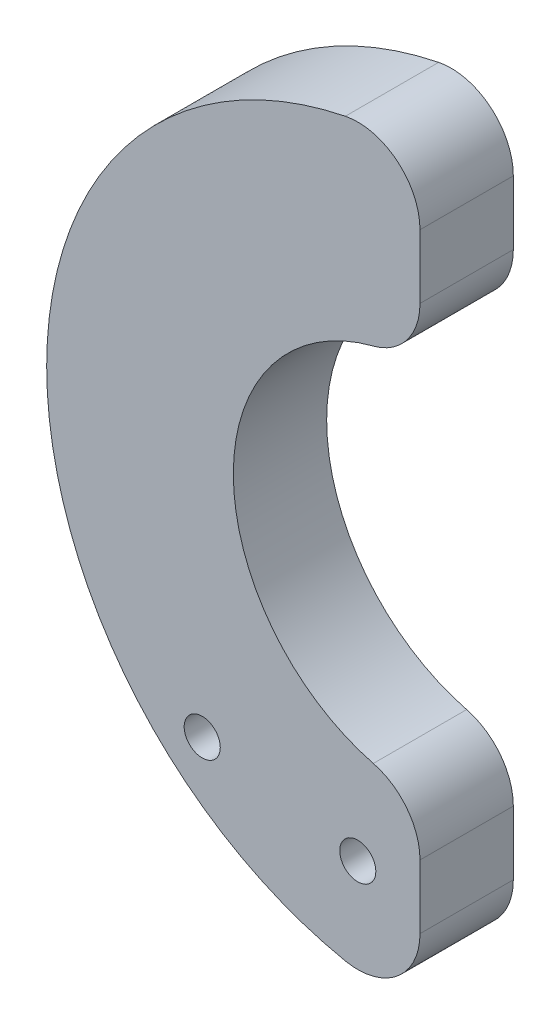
ISO-10303-21;
HEADER;
FILE_DESCRIPTION(('STEP AP214'),'2;1');
FILE_NAME('part.step','',(''),(''),'','','');
FILE_SCHEMA(('AUTOMOTIVE_DESIGN { 1 0 10303 214 1 1 1 1 }'));
ENDSEC;
DATA;
#1=APPLICATION_CONTEXT('core data for automotive mechanical design processes');
#2=APPLICATION_PROTOCOL_DEFINITION('international standard','automotive_design',2000,#1);
#3=PRODUCT_CONTEXT('',#1,'mechanical');
#4=PRODUCT('Part','Part','',(#3));
#5=PRODUCT_RELATED_PRODUCT_CATEGORY('part','',(#4));
#6=PRODUCT_DEFINITION_FORMATION('','',#4);
#7=PRODUCT_DEFINITION_CONTEXT('part definition',#1,'design');
#8=PRODUCT_DEFINITION('design','',#6,#7);
#9=PRODUCT_DEFINITION_SHAPE('','',#8);
#10=(LENGTH_UNIT() NAMED_UNIT(*) SI_UNIT(.MILLI.,.METRE.));
#11=(NAMED_UNIT(*) PLANE_ANGLE_UNIT() SI_UNIT($,.RADIAN.));
#12=(NAMED_UNIT(*) SI_UNIT($,.STERADIAN.) SOLID_ANGLE_UNIT());
#13=UNCERTAINTY_MEASURE_WITH_UNIT(LENGTH_MEASURE(1.E-05),#10,'distance_accuracy_value','');
#14=(GEOMETRIC_REPRESENTATION_CONTEXT(3) GLOBAL_UNCERTAINTY_ASSIGNED_CONTEXT((#13)) GLOBAL_UNIT_ASSIGNED_CONTEXT((#10,
#11,#12)) REPRESENTATION_CONTEXT('',''));
#15=CARTESIAN_POINT('',(0.,0.,0.));
#16=DIRECTION('',(0.,0.,1.));
#17=DIRECTION('',(1.,0.,0.));
#18=AXIS2_PLACEMENT_3D('',#15,#16,#17);
#19=CARTESIAN_POINT('',(-3.175,12.2967221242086,4.7625));
#20=DIRECTION('',(0.,0.,-1.));
#21=DIRECTION('',(-1.,0.,0.));
#22=AXIS2_PLACEMENT_3D('',#19,#20,#21);
#23=CYLINDRICAL_SURFACE('',#22,3.175);
#24=CARTESIAN_POINT('',(-3.175,12.2967221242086,0.));
#25=DIRECTION('',(0.,0.,-1.));
#26=DIRECTION('',(-1.,0.,0.));
#27=AXIS2_PLACEMENT_3D('',#24,#25,#26);
#28=CIRCLE('',#27,3.175);
#29=CARTESIAN_POINT('',(0.,12.2967221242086,0.));
#30=VERTEX_POINT('',#29);
#31=CARTESIAN_POINT('',(-2.38125,9.22254159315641,0.));
#32=VERTEX_POINT('',#31);
#33=EDGE_CURVE('E141',#30,#32,#28,.T.);
#34=ORIENTED_EDGE('',*,*,#33,.F.);
#35=DIRECTION('',(0.,0.,-1.));
#36=VECTOR('',#35,1.);
#37=CARTESIAN_POINT('',(0.,12.2967221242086,4.7625));
#38=LINE('',#37,#36);
#39=CARTESIAN_POINT('',(0.,12.2967221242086,4.7625));
#40=VERTEX_POINT('',#39);
#41=EDGE_CURVE('E13',#40,#30,#38,.T.);
#42=ORIENTED_EDGE('',*,*,#41,.F.);
#43=CARTESIAN_POINT('',(-3.175,12.2967221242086,4.7625));
#44=DIRECTION('',(0.,0.,-1.));
#45=DIRECTION('',(-1.,0.,0.));
#46=AXIS2_PLACEMENT_3D('',#43,#44,#45);
#47=CIRCLE('',#46,3.175);
#48=CARTESIAN_POINT('',(-2.38125,9.22254159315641,4.7625));
#49=VERTEX_POINT('',#48);
#50=EDGE_CURVE('E162',#40,#49,#47,.T.);
#51=ORIENTED_EDGE('',*,*,#50,.T.);
#52=DIRECTION('',(0.,0.,-1.));
#53=VECTOR('',#52,1.);
#54=CARTESIAN_POINT('',(-2.38125,9.22254159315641,4.7625));
#55=LINE('',#54,#53);
#56=EDGE_CURVE('E47',#49,#32,#55,.T.);
#57=ORIENTED_EDGE('',*,*,#56,.T.);
#58=EDGE_LOOP('',(#34,#42,#51,#57));
#59=FACE_BOUND('',#58,.T.);
#60=ADVANCED_FACE('F44',(#59),#23,.T.);
#61=CARTESIAN_POINT('',(0.,15.5542598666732,4.7625));
#62=DIRECTION('',(1.,0.,0.));
#63=DIRECTION('',(0.,1.,0.));
#64=AXIS2_PLACEMENT_3D('',#61,#62,#63);
#65=PLANE('',#64);
#66=DIRECTION('',(0.,-1.,0.));
#67=VECTOR('',#66,1.);
#68=CARTESIAN_POINT('',(0.,15.5542598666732,0.));
#69=LINE('',#68,#67);
#70=CARTESIAN_POINT('',(0.,15.5542598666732,0.));
#71=VERTEX_POINT('',#70);
#72=EDGE_CURVE('E160',#71,#30,#69,.T.);
#73=ORIENTED_EDGE('',*,*,#72,.F.);
#74=DIRECTION('',(0.,0.,-1.));
#75=VECTOR('',#74,1.);
#76=CARTESIAN_POINT('',(0.,15.5542598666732,4.7625));
#77=LINE('',#76,#75);
#78=CARTESIAN_POINT('',(0.,15.5542598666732,4.7625));
#79=VERTEX_POINT('',#78);
#80=EDGE_CURVE('E53',#79,#71,#77,.T.);
#81=ORIENTED_EDGE('',*,*,#80,.F.);
#82=DIRECTION('',(0.,-1.,0.));
#83=VECTOR('',#82,1.);
#84=CARTESIAN_POINT('',(0.,15.5542598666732,4.7625));
#85=LINE('',#84,#83);
#86=EDGE_CURVE('E123',#79,#40,#85,.T.);
#87=ORIENTED_EDGE('',*,*,#86,.T.);
#88=ORIENTED_EDGE('',*,*,#41,.T.);
#89=EDGE_LOOP('',(#73,#81,#87,#88));
#90=FACE_BOUND('',#89,.T.);
#91=ADVANCED_FACE('F175',(#90),#65,.T.);
#92=CARTESIAN_POINT('',(-3.175,15.5542598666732,4.7625));
#93=DIRECTION('',(0.,0.,-1.));
#94=DIRECTION('',(-1.,0.,0.));
#95=AXIS2_PLACEMENT_3D('',#92,#93,#94);
#96=CYLINDRICAL_SURFACE('',#95,3.175);
#97=CARTESIAN_POINT('',(-3.175,15.5542598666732,0.));
#98=DIRECTION('',(0.,0.,1.));
#99=DIRECTION('',(1.,0.,0.));
#100=AXIS2_PLACEMENT_3D('',#97,#98,#99);
#101=CIRCLE('',#100,3.175);
#102=CARTESIAN_POINT('',(-3.81,18.6651118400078,0.));
#103=VERTEX_POINT('',#102);
#104=EDGE_CURVE('E127',#71,#103,#101,.T.);
#105=ORIENTED_EDGE('',*,*,#104,.T.);
#106=DIRECTION('',(0.,0.,-1.));
#107=VECTOR('',#106,1.);
#108=CARTESIAN_POINT('',(-3.81,18.6651118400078,4.7625));
#109=LINE('',#108,#107);
#110=CARTESIAN_POINT('',(-3.81,18.6651118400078,4.7625));
#111=VERTEX_POINT('',#110);
#112=EDGE_CURVE('E125',#111,#103,#109,.T.);
#113=ORIENTED_EDGE('',*,*,#112,.F.);
#114=CARTESIAN_POINT('',(-3.175,15.5542598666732,4.7625));
#115=DIRECTION('',(0.,0.,1.));
#116=DIRECTION('',(1.,0.,0.));
#117=AXIS2_PLACEMENT_3D('',#114,#115,#116);
#118=CIRCLE('',#117,3.175);
#119=EDGE_CURVE('E116',#79,#111,#118,.T.);
#120=ORIENTED_EDGE('',*,*,#119,.F.);
#121=ORIENTED_EDGE('',*,*,#80,.T.);
#122=EDGE_LOOP('',(#105,#113,#120,#121));
#123=FACE_BOUND('',#122,.T.);
#124=ADVANCED_FACE('F126',(#123),#96,.T.);
#125=CARTESIAN_POINT('',(0.,0.,4.7625));
#126=DIRECTION('',(0.,0.,-1.));
#127=DIRECTION('',(-1.,0.,0.));
#128=AXIS2_PLACEMENT_3D('',#125,#126,#127);
#129=CYLINDRICAL_SURFACE('',#128,19.05);
#130=CARTESIAN_POINT('',(0.,0.,0.));
#131=DIRECTION('',(0.,0.,-1.));
#132=DIRECTION('',(-1.,0.,0.));
#133=AXIS2_PLACEMENT_3D('',#130,#131,#132);
#134=CIRCLE('',#133,19.05);
#135=CARTESIAN_POINT('',(-3.81,-18.6651118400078,0.));
#136=VERTEX_POINT('',#135);
#137=EDGE_CURVE('E157',#136,#103,#134,.T.);
#138=ORIENTED_EDGE('',*,*,#137,.F.);
#139=DIRECTION('',(0.,0.,-1.));
#140=VECTOR('',#139,1.);
#141=CARTESIAN_POINT('',(-3.81,-18.6651118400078,4.7625));
#142=LINE('',#141,#140);
#143=CARTESIAN_POINT('',(-3.81,-18.6651118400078,4.7625));
#144=VERTEX_POINT('',#143);
#145=EDGE_CURVE('E131',#144,#136,#142,.T.);
#146=ORIENTED_EDGE('',*,*,#145,.F.);
#147=CARTESIAN_POINT('',(0.,0.,4.7625));
#148=DIRECTION('',(0.,0.,-1.));
#149=DIRECTION('',(-1.,0.,0.));
#150=AXIS2_PLACEMENT_3D('',#147,#148,#149);
#151=CIRCLE('',#150,19.05);
#152=EDGE_CURVE('E121',#144,#111,#151,.T.);
#153=ORIENTED_EDGE('',*,*,#152,.T.);
#154=ORIENTED_EDGE('',*,*,#112,.T.);
#155=EDGE_LOOP('',(#138,#146,#153,#154));
#156=FACE_BOUND('',#155,.T.);
#157=ADVANCED_FACE('F133',(#156),#129,.T.);
#158=CARTESIAN_POINT('',(-3.175,-15.5542598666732,4.7625));
#159=DIRECTION('',(0.,0.,-1.));
#160=DIRECTION('',(-1.,0.,0.));
#161=AXIS2_PLACEMENT_3D('',#158,#159,#160);
#162=CYLINDRICAL_SURFACE('',#161,3.175);
#163=CARTESIAN_POINT('',(-3.175,-15.5542598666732,0.));
#164=DIRECTION('',(0.,0.,-1.));
#165=DIRECTION('',(-1.,0.,0.));
#166=AXIS2_PLACEMENT_3D('',#163,#164,#165);
#167=CIRCLE('',#166,3.175);
#168=CARTESIAN_POINT('',(0.,-15.5542598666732,0.));
#169=VERTEX_POINT('',#168);
#170=EDGE_CURVE('E154',#169,#136,#167,.T.);
#171=ORIENTED_EDGE('',*,*,#170,.F.);
#172=DIRECTION('',(0.,0.,-1.));
#173=VECTOR('',#172,1.);
#174=CARTESIAN_POINT('',(0.,-15.5542598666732,4.7625));
#175=LINE('',#174,#173);
#176=CARTESIAN_POINT('',(0.,-15.5542598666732,4.7625));
#177=VERTEX_POINT('',#176);
#178=EDGE_CURVE('E166',#177,#169,#175,.T.);
#179=ORIENTED_EDGE('',*,*,#178,.F.);
#180=CARTESIAN_POINT('',(-3.175,-15.5542598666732,4.7625));
#181=DIRECTION('',(0.,0.,-1.));
#182=DIRECTION('',(-1.,0.,0.));
#183=AXIS2_PLACEMENT_3D('',#180,#181,#182);
#184=CIRCLE('',#183,3.175);
#185=EDGE_CURVE('E134',#177,#144,#184,.T.);
#186=ORIENTED_EDGE('',*,*,#185,.T.);
#187=ORIENTED_EDGE('',*,*,#145,.T.);
#188=EDGE_LOOP('',(#171,#179,#186,#187));
#189=FACE_BOUND('',#188,.T.);
#190=ADVANCED_FACE('F188',(#189),#162,.T.);
#191=CARTESIAN_POINT('',(0.,-12.2967221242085,4.7625));
#192=DIRECTION('',(1.,0.,0.));
#193=DIRECTION('',(0.,1.,0.));
#194=AXIS2_PLACEMENT_3D('',#191,#192,#193);
#195=PLANE('',#194);
#196=DIRECTION('',(0.,-1.,0.));
#197=VECTOR('',#196,1.);
#198=CARTESIAN_POINT('',(0.,-12.2967221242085,0.));
#199=LINE('',#198,#197);
#200=CARTESIAN_POINT('',(0.,-12.2967221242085,0.));
#201=VERTEX_POINT('',#200);
#202=EDGE_CURVE('E151',#201,#169,#199,.T.);
#203=ORIENTED_EDGE('',*,*,#202,.F.);
#204=DIRECTION('',(0.,0.,-1.));
#205=VECTOR('',#204,1.);
#206=CARTESIAN_POINT('',(0.,-12.2967221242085,4.7625));
#207=LINE('',#206,#205);
#208=CARTESIAN_POINT('',(0.,-12.2967221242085,4.7625));
#209=VERTEX_POINT('',#208);
#210=EDGE_CURVE('E168',#209,#201,#207,.T.);
#211=ORIENTED_EDGE('',*,*,#210,.F.);
#212=DIRECTION('',(0.,-1.,0.));
#213=VECTOR('',#212,1.);
#214=CARTESIAN_POINT('',(0.,-12.2967221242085,4.7625));
#215=LINE('',#214,#213);
#216=EDGE_CURVE('E136',#209,#177,#215,.T.);
#217=ORIENTED_EDGE('',*,*,#216,.T.);
#218=ORIENTED_EDGE('',*,*,#178,.T.);
#219=EDGE_LOOP('',(#203,#211,#217,#218));
#220=FACE_BOUND('',#219,.T.);
#221=ADVANCED_FACE('F191',(#220),#195,.T.);
#222=CARTESIAN_POINT('',(-3.175,-12.2967221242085,4.7625));
#223=DIRECTION('',(0.,0.,-1.));
#224=DIRECTION('',(-1.,0.,0.));
#225=AXIS2_PLACEMENT_3D('',#222,#223,#224);
#226=CYLINDRICAL_SURFACE('',#225,3.175);
#227=CARTESIAN_POINT('',(-3.175,-12.2967221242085,0.));
#228=DIRECTION('',(0.,0.,1.));
#229=DIRECTION('',(1.,0.,0.));
#230=AXIS2_PLACEMENT_3D('',#227,#228,#229);
#231=CIRCLE('',#230,3.175);
#232=CARTESIAN_POINT('',(-2.38125,-9.22254159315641,0.));
#233=VERTEX_POINT('',#232);
#234=EDGE_CURVE('E148',#201,#233,#231,.T.);
#235=ORIENTED_EDGE('',*,*,#234,.T.);
#236=DIRECTION('',(0.,0.,-1.));
#237=VECTOR('',#236,1.);
#238=CARTESIAN_POINT('',(-2.38125,-9.22254159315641,4.7625));
#239=LINE('',#238,#237);
#240=CARTESIAN_POINT('',(-2.38125,-9.22254159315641,4.7625));
#241=VERTEX_POINT('',#240);
#242=EDGE_CURVE('E169',#241,#233,#239,.T.);
#243=ORIENTED_EDGE('',*,*,#242,.F.);
#244=CARTESIAN_POINT('',(-3.175,-12.2967221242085,4.7625));
#245=DIRECTION('',(0.,0.,1.));
#246=DIRECTION('',(1.,0.,0.));
#247=AXIS2_PLACEMENT_3D('',#244,#245,#246);
#248=CIRCLE('',#247,3.175);
#249=EDGE_CURVE('E237',#209,#241,#248,.T.);
#250=ORIENTED_EDGE('',*,*,#249,.F.);
#251=ORIENTED_EDGE('',*,*,#210,.T.);
#252=EDGE_LOOP('',(#235,#243,#250,#251));
#253=FACE_BOUND('',#252,.T.);
#254=ADVANCED_FACE('F195',(#253),#226,.T.);
#255=CARTESIAN_POINT('',(0.,0.,4.7625));
#256=DIRECTION('',(0.,0.,-1.));
#257=DIRECTION('',(-1.,0.,0.));
#258=AXIS2_PLACEMENT_3D('',#255,#256,#257);
#259=CYLINDRICAL_SURFACE('',#258,9.525);
#260=CARTESIAN_POINT('',(0.,0.,0.));
#261=DIRECTION('',(0.,0.,1.));
#262=DIRECTION('',(1.,0.,0.));
#263=AXIS2_PLACEMENT_3D('',#260,#261,#262);
#264=CIRCLE('',#263,9.525);
#265=EDGE_CURVE('E144',#32,#233,#264,.T.);
#266=ORIENTED_EDGE('',*,*,#265,.F.);
#267=ORIENTED_EDGE('',*,*,#56,.F.);
#268=CARTESIAN_POINT('',(0.,0.,4.7625));
#269=DIRECTION('',(0.,0.,1.));
#270=DIRECTION('',(1.,0.,0.));
#271=AXIS2_PLACEMENT_3D('',#268,#269,#270);
#272=CIRCLE('',#271,9.525);
#273=EDGE_CURVE('E235',#49,#241,#272,.T.);
#274=ORIENTED_EDGE('',*,*,#273,.T.);
#275=ORIENTED_EDGE('',*,*,#242,.T.);
#276=EDGE_LOOP('',(#266,#267,#274,#275));
#277=FACE_BOUND('',#276,.T.);
#278=ADVANCED_FACE('F171',(#277),#259,.F.);
#279=CARTESIAN_POINT('',(-3.175,12.2967221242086,4.7625));
#280=DIRECTION('',(0.,0.,-1.));
#281=DIRECTION('',(-1.,0.,0.));
#282=AXIS2_PLACEMENT_3D('',#279,#280,#281);
#283=PLANE('',#282);
#284=CARTESIAN_POINT('',(-3.175,-13.930255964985,4.7625));
#285=DIRECTION('',(0.,0.,1.));
#286=DIRECTION('',(1.,0.,0.));
#287=AXIS2_PLACEMENT_3D('',#284,#285,#286);
#288=CIRCLE('',#287,0.92075);
#289=CARTESIAN_POINT('',(-2.25425,-13.930255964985,4.7625));
#290=VERTEX_POINT('',#289);
#291=EDGE_CURVE('E224',#290,#290,#288,.T.);
#292=ORIENTED_EDGE('',*,*,#291,.F.);
#293=EDGE_LOOP('',(#292));
#294=FACE_BOUND('',#293,.T.);
#295=CARTESIAN_POINT('',(-11.1125,-12.4241526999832,4.7625));
#296=DIRECTION('',(0.,0.,1.));
#297=DIRECTION('',(1.,0.,0.));
#298=AXIS2_PLACEMENT_3D('',#295,#296,#297);
#299=CIRCLE('',#298,0.92075);
#300=CARTESIAN_POINT('',(-10.19175,-12.4241526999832,4.7625));
#301=VERTEX_POINT('',#300);
#302=EDGE_CURVE('E225',#301,#301,#299,.T.);
#303=ORIENTED_EDGE('',*,*,#302,.F.);
#304=EDGE_LOOP('',(#303));
#305=FACE_BOUND('',#304,.T.);
#306=ORIENTED_EDGE('',*,*,#50,.F.);
#307=ORIENTED_EDGE('',*,*,#86,.F.);
#308=ORIENTED_EDGE('',*,*,#119,.T.);
#309=ORIENTED_EDGE('',*,*,#152,.F.);
#310=ORIENTED_EDGE('',*,*,#185,.F.);
#311=ORIENTED_EDGE('',*,*,#216,.F.);
#312=ORIENTED_EDGE('',*,*,#249,.T.);
#313=ORIENTED_EDGE('',*,*,#273,.F.);
#314=EDGE_LOOP('',(#306,#307,#308,#309,#310,#311,#312,#313));
#315=FACE_BOUND('',#314,.T.);
#316=ADVANCED_FACE('F118',(#294,#305,#315),#283,.F.);
#317=CARTESIAN_POINT('',(-3.175,12.2967221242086,0.));
#318=DIRECTION('',(0.,0.,-1.));
#319=DIRECTION('',(-1.,0.,0.));
#320=AXIS2_PLACEMENT_3D('',#317,#318,#319);
#321=PLANE('',#320);
#322=CARTESIAN_POINT('',(-3.175,-13.930255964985,0.));
#323=DIRECTION('',(0.,0.,1.));
#324=DIRECTION('',(1.,0.,0.));
#325=AXIS2_PLACEMENT_3D('',#322,#323,#324);
#326=CIRCLE('',#325,0.92075);
#327=CARTESIAN_POINT('',(-2.25425,-13.930255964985,0.));
#328=VERTEX_POINT('',#327);
#329=EDGE_CURVE('E145',#328,#328,#326,.T.);
#330=ORIENTED_EDGE('',*,*,#329,.T.);
#331=EDGE_LOOP('',(#330));
#332=FACE_BOUND('',#331,.T.);
#333=CARTESIAN_POINT('',(-11.1125,-12.4241526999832,0.));
#334=DIRECTION('',(0.,0.,1.));
#335=DIRECTION('',(1.,0.,0.));
#336=AXIS2_PLACEMENT_3D('',#333,#334,#335);
#337=CIRCLE('',#336,0.92075);
#338=CARTESIAN_POINT('',(-10.19175,-12.4241526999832,0.));
#339=VERTEX_POINT('',#338);
#340=EDGE_CURVE('E229',#339,#339,#337,.T.);
#341=ORIENTED_EDGE('',*,*,#340,.T.);
#342=EDGE_LOOP('',(#341));
#343=FACE_BOUND('',#342,.T.);
#344=ORIENTED_EDGE('',*,*,#33,.T.);
#345=ORIENTED_EDGE('',*,*,#265,.T.);
#346=ORIENTED_EDGE('',*,*,#234,.F.);
#347=ORIENTED_EDGE('',*,*,#202,.T.);
#348=ORIENTED_EDGE('',*,*,#170,.T.);
#349=ORIENTED_EDGE('',*,*,#137,.T.);
#350=ORIENTED_EDGE('',*,*,#104,.F.);
#351=ORIENTED_EDGE('',*,*,#72,.T.);
#352=EDGE_LOOP('',(#344,#345,#346,#347,#348,#349,#350,#351));
#353=FACE_BOUND('',#352,.T.);
#354=ADVANCED_FACE('F174',(#332,#343,#353),#321,.T.);
#355=CARTESIAN_POINT('',(-11.1125,-12.4241526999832,0.));
#356=DIRECTION('',(0.,0.,1.));
#357=DIRECTION('',(1.,0.,0.));
#358=AXIS2_PLACEMENT_3D('',#355,#356,#357);
#359=CYLINDRICAL_SURFACE('',#358,0.92075);
#360=CARTESIAN_POINT('',(-10.19175,-12.4241526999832,0.));
#361=CARTESIAN_POINT('',(-10.19175,-12.4241526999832,0.049609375));
#362=CARTESIAN_POINT('',(-10.19175,-12.4241526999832,0.09921875));
#363=CARTESIAN_POINT('',(-10.19175,-12.4241526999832,0.1984375));
#364=CARTESIAN_POINT('',(-10.19175,-12.4241526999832,0.248046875));
#365=CARTESIAN_POINT('',(-10.19175,-12.4241526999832,0.347265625));
#366=CARTESIAN_POINT('',(-10.19175,-12.4241526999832,0.396875));
#367=CARTESIAN_POINT('',(-10.19175,-12.4241526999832,0.49609375));
#368=CARTESIAN_POINT('',(-10.19175,-12.4241526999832,0.545703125));
#369=CARTESIAN_POINT('',(-10.19175,-12.4241526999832,0.644921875));
#370=CARTESIAN_POINT('',(-10.19175,-12.4241526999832,0.69453125));
#371=CARTESIAN_POINT('',(-10.19175,-12.4241526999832,0.79375));
#372=CARTESIAN_POINT('',(-10.19175,-12.4241526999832,0.843359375));
#373=CARTESIAN_POINT('',(-10.19175,-12.4241526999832,0.942578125));
#374=CARTESIAN_POINT('',(-10.19175,-12.4241526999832,0.9921875));
#375=CARTESIAN_POINT('',(-10.19175,-12.4241526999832,1.09140625));
#376=CARTESIAN_POINT('',(-10.19175,-12.4241526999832,1.141015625));
#377=CARTESIAN_POINT('',(-10.19175,-12.4241526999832,1.240234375));
#378=CARTESIAN_POINT('',(-10.19175,-12.4241526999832,1.28984375));
#379=CARTESIAN_POINT('',(-10.19175,-12.4241526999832,1.3890625));
#380=CARTESIAN_POINT('',(-10.19175,-12.4241526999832,1.438671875));
#381=CARTESIAN_POINT('',(-10.19175,-12.4241526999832,1.537890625));
#382=CARTESIAN_POINT('',(-10.19175,-12.4241526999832,1.5875));
#383=CARTESIAN_POINT('',(-10.19175,-12.4241526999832,1.68671875));
#384=CARTESIAN_POINT('',(-10.19175,-12.4241526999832,1.736328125));
#385=CARTESIAN_POINT('',(-10.19175,-12.4241526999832,1.835546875));
#386=CARTESIAN_POINT('',(-10.19175,-12.4241526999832,1.88515625));
#387=CARTESIAN_POINT('',(-10.19175,-12.4241526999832,1.984375));
#388=CARTESIAN_POINT('',(-10.19175,-12.4241526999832,2.033984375));
#389=CARTESIAN_POINT('',(-10.19175,-12.4241526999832,2.133203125));
#390=CARTESIAN_POINT('',(-10.19175,-12.4241526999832,2.1828125));
#391=CARTESIAN_POINT('',(-10.19175,-12.4241526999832,2.28203125));
#392=CARTESIAN_POINT('',(-10.19175,-12.4241526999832,2.331640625));
#393=CARTESIAN_POINT('',(-10.19175,-12.4241526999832,2.430859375));
#394=CARTESIAN_POINT('',(-10.19175,-12.4241526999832,2.48046875));
#395=CARTESIAN_POINT('',(-10.19175,-12.4241526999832,2.5796875));
#396=CARTESIAN_POINT('',(-10.19175,-12.4241526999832,2.629296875));
#397=CARTESIAN_POINT('',(-10.19175,-12.4241526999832,2.728515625));
#398=CARTESIAN_POINT('',(-10.19175,-12.4241526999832,2.778125));
#399=CARTESIAN_POINT('',(-10.19175,-12.4241526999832,2.87734375));
#400=CARTESIAN_POINT('',(-10.19175,-12.4241526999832,2.926953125));
#401=CARTESIAN_POINT('',(-10.19175,-12.4241526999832,3.026171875));
#402=CARTESIAN_POINT('',(-10.19175,-12.4241526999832,3.07578125));
#403=CARTESIAN_POINT('',(-10.19175,-12.4241526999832,3.175));
#404=CARTESIAN_POINT('',(-10.19175,-12.4241526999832,3.224609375));
#405=CARTESIAN_POINT('',(-10.19175,-12.4241526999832,3.323828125));
#406=CARTESIAN_POINT('',(-10.19175,-12.4241526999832,3.3734375));
#407=CARTESIAN_POINT('',(-10.19175,-12.4241526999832,3.47265625));
#408=CARTESIAN_POINT('',(-10.19175,-12.4241526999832,3.522265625));
#409=CARTESIAN_POINT('',(-10.19175,-12.4241526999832,3.621484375));
#410=CARTESIAN_POINT('',(-10.19175,-12.4241526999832,3.67109375));
#411=CARTESIAN_POINT('',(-10.19175,-12.4241526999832,3.7703125));
#412=CARTESIAN_POINT('',(-10.19175,-12.4241526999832,3.819921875));
#413=CARTESIAN_POINT('',(-10.19175,-12.4241526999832,3.919140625));
#414=CARTESIAN_POINT('',(-10.19175,-12.4241526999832,3.96875));
#415=CARTESIAN_POINT('',(-10.19175,-12.4241526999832,4.06796875));
#416=CARTESIAN_POINT('',(-10.19175,-12.4241526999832,4.117578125));
#417=CARTESIAN_POINT('',(-10.19175,-12.4241526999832,4.216796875));
#418=CARTESIAN_POINT('',(-10.19175,-12.4241526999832,4.26640625));
#419=CARTESIAN_POINT('',(-10.19175,-12.4241526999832,4.365625));
#420=CARTESIAN_POINT('',(-10.19175,-12.4241526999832,4.415234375));
#421=CARTESIAN_POINT('',(-10.19175,-12.4241526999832,4.514453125));
#422=CARTESIAN_POINT('',(-10.19175,-12.4241526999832,4.5640625));
#423=CARTESIAN_POINT('',(-10.19175,-12.4241526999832,4.66328125));
#424=CARTESIAN_POINT('',(-10.19175,-12.4241526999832,4.712890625));
#425=CARTESIAN_POINT('',(-10.19175,-12.4241526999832,4.7625));
#426=B_SPLINE_CURVE_WITH_KNOTS('',3,(#360,#361,#362,#363,#364,#365,#366,#367,#368,#369,#370,
#371,#372,#373,#374,#375,#376,#377,#378,#379,#380,#381,#382,#383,#384,#385,#386,#387,#388,#389,
#390,#391,#392,#393,#394,#395,#396,#397,#398,#399,#400,#401,#402,#403,#404,#405,#406,#407,#408,
#409,#410,#411,#412,#413,#414,#415,#416,#417,#418,#419,#420,#421,#422,#423,#424,#425),
.UNSPECIFIED.,.F.,.F.,(4,2,2,2,2,2,2,2,2,2,2,2,2,2,2,2,2,2,2,2,2,2,2,2,2,2,2,2,2,2,2,2,4),(0.,
0.148828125,0.29765625,0.446484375,0.5953125,0.744140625,0.89296875,1.041796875,1.190625,
1.339453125,1.48828125,1.637109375,1.7859375,1.934765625,2.08359375,2.232421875,2.38125,
2.530078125,2.67890625,2.827734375,2.9765625,3.125390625,3.27421875,3.423046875,3.571875,
3.720703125,3.86953125,4.018359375,4.1671875,4.316015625,4.46484375,4.613671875,4.7625),.UNSPECIFIED.);
#427=EDGE_CURVE('BSEAM207',#339,#301,#426,.T.);
#428=ORIENTED_EDGE('',*,*,#340,.F.);
#429=ORIENTED_EDGE('',*,*,#302,.T.);
#430=ORIENTED_EDGE('',*,*,#427,.T.);
#431=ORIENTED_EDGE('',*,*,#427,.F.);
#432=EDGE_LOOP('',(#428,#430,#429,#431));
#433=FACE_BOUND('',#432,.T.);
#434=ADVANCED_FACE('F207',(#433),#359,.F.);
#435=CARTESIAN_POINT('',(-3.175,-13.930255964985,0.));
#436=DIRECTION('',(0.,0.,1.));
#437=DIRECTION('',(1.,0.,0.));
#438=AXIS2_PLACEMENT_3D('',#435,#436,#437);
#439=CYLINDRICAL_SURFACE('',#438,0.92075);
#440=CARTESIAN_POINT('',(-2.25425,-13.930255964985,0.));
#441=CARTESIAN_POINT('',(-2.25425,-13.930255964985,0.049609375));
#442=CARTESIAN_POINT('',(-2.25425,-13.930255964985,0.09921875));
#443=CARTESIAN_POINT('',(-2.25425,-13.930255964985,0.1984375));
#444=CARTESIAN_POINT('',(-2.25425,-13.930255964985,0.248046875));
#445=CARTESIAN_POINT('',(-2.25425,-13.930255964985,0.347265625));
#446=CARTESIAN_POINT('',(-2.25425,-13.930255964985,0.396875));
#447=CARTESIAN_POINT('',(-2.25425,-13.930255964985,0.49609375));
#448=CARTESIAN_POINT('',(-2.25425,-13.930255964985,0.545703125));
#449=CARTESIAN_POINT('',(-2.25425,-13.930255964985,0.644921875));
#450=CARTESIAN_POINT('',(-2.25425,-13.930255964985,0.69453125));
#451=CARTESIAN_POINT('',(-2.25425,-13.930255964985,0.79375));
#452=CARTESIAN_POINT('',(-2.25425,-13.930255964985,0.843359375));
#453=CARTESIAN_POINT('',(-2.25425,-13.930255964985,0.942578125));
#454=CARTESIAN_POINT('',(-2.25425,-13.930255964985,0.9921875));
#455=CARTESIAN_POINT('',(-2.25425,-13.930255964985,1.09140625));
#456=CARTESIAN_POINT('',(-2.25425,-13.930255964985,1.141015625));
#457=CARTESIAN_POINT('',(-2.25425,-13.930255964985,1.240234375));
#458=CARTESIAN_POINT('',(-2.25425,-13.930255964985,1.28984375));
#459=CARTESIAN_POINT('',(-2.25425,-13.930255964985,1.3890625));
#460=CARTESIAN_POINT('',(-2.25425,-13.930255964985,1.438671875));
#461=CARTESIAN_POINT('',(-2.25425,-13.930255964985,1.537890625));
#462=CARTESIAN_POINT('',(-2.25425,-13.930255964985,1.5875));
#463=CARTESIAN_POINT('',(-2.25425,-13.930255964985,1.68671875));
#464=CARTESIAN_POINT('',(-2.25425,-13.930255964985,1.736328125));
#465=CARTESIAN_POINT('',(-2.25425,-13.930255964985,1.835546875));
#466=CARTESIAN_POINT('',(-2.25425,-13.930255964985,1.88515625));
#467=CARTESIAN_POINT('',(-2.25425,-13.930255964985,1.984375));
#468=CARTESIAN_POINT('',(-2.25425,-13.930255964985,2.033984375));
#469=CARTESIAN_POINT('',(-2.25425,-13.930255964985,2.133203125));
#470=CARTESIAN_POINT('',(-2.25425,-13.930255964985,2.1828125));
#471=CARTESIAN_POINT('',(-2.25425,-13.930255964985,2.28203125));
#472=CARTESIAN_POINT('',(-2.25425,-13.930255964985,2.331640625));
#473=CARTESIAN_POINT('',(-2.25425,-13.930255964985,2.430859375));
#474=CARTESIAN_POINT('',(-2.25425,-13.930255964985,2.48046875));
#475=CARTESIAN_POINT('',(-2.25425,-13.930255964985,2.5796875));
#476=CARTESIAN_POINT('',(-2.25425,-13.930255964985,2.629296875));
#477=CARTESIAN_POINT('',(-2.25425,-13.930255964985,2.728515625));
#478=CARTESIAN_POINT('',(-2.25425,-13.930255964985,2.778125));
#479=CARTESIAN_POINT('',(-2.25425,-13.930255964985,2.87734375));
#480=CARTESIAN_POINT('',(-2.25425,-13.930255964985,2.926953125));
#481=CARTESIAN_POINT('',(-2.25425,-13.930255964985,3.026171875));
#482=CARTESIAN_POINT('',(-2.25425,-13.930255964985,3.07578125));
#483=CARTESIAN_POINT('',(-2.25425,-13.930255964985,3.175));
#484=CARTESIAN_POINT('',(-2.25425,-13.930255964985,3.224609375));
#485=CARTESIAN_POINT('',(-2.25425,-13.930255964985,3.323828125));
#486=CARTESIAN_POINT('',(-2.25425,-13.930255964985,3.3734375));
#487=CARTESIAN_POINT('',(-2.25425,-13.930255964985,3.47265625));
#488=CARTESIAN_POINT('',(-2.25425,-13.930255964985,3.522265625));
#489=CARTESIAN_POINT('',(-2.25425,-13.930255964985,3.621484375));
#490=CARTESIAN_POINT('',(-2.25425,-13.930255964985,3.67109375));
#491=CARTESIAN_POINT('',(-2.25425,-13.930255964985,3.7703125));
#492=CARTESIAN_POINT('',(-2.25425,-13.930255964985,3.819921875));
#493=CARTESIAN_POINT('',(-2.25425,-13.930255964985,3.919140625));
#494=CARTESIAN_POINT('',(-2.25425,-13.930255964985,3.96875));
#495=CARTESIAN_POINT('',(-2.25425,-13.930255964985,4.06796875));
#496=CARTESIAN_POINT('',(-2.25425,-13.930255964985,4.117578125));
#497=CARTESIAN_POINT('',(-2.25425,-13.930255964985,4.216796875));
#498=CARTESIAN_POINT('',(-2.25425,-13.930255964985,4.26640625));
#499=CARTESIAN_POINT('',(-2.25425,-13.930255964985,4.365625));
#500=CARTESIAN_POINT('',(-2.25425,-13.930255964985,4.415234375));
#501=CARTESIAN_POINT('',(-2.25425,-13.930255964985,4.514453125));
#502=CARTESIAN_POINT('',(-2.25425,-13.930255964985,4.5640625));
#503=CARTESIAN_POINT('',(-2.25425,-13.930255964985,4.66328125));
#504=CARTESIAN_POINT('',(-2.25425,-13.930255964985,4.712890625));
#505=CARTESIAN_POINT('',(-2.25425,-13.930255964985,4.7625));
#506=B_SPLINE_CURVE_WITH_KNOTS('',3,(#440,#441,#442,#443,#444,#445,#446,#447,#448,#449,#450,
#451,#452,#453,#454,#455,#456,#457,#458,#459,#460,#461,#462,#463,#464,#465,#466,#467,#468,#469,
#470,#471,#472,#473,#474,#475,#476,#477,#478,#479,#480,#481,#482,#483,#484,#485,#486,#487,#488,
#489,#490,#491,#492,#493,#494,#495,#496,#497,#498,#499,#500,#501,#502,#503,#504,#505),
.UNSPECIFIED.,.F.,.F.,(4,2,2,2,2,2,2,2,2,2,2,2,2,2,2,2,2,2,2,2,2,2,2,2,2,2,2,2,2,2,2,2,4),(0.,
0.148828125,0.29765625,0.446484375,0.5953125,0.744140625,0.89296875,1.041796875,1.190625,
1.339453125,1.48828125,1.637109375,1.7859375,1.934765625,2.08359375,2.232421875,2.38125,
2.530078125,2.67890625,2.827734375,2.9765625,3.125390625,3.27421875,3.423046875,3.571875,
3.720703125,3.86953125,4.018359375,4.1671875,4.316015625,4.46484375,4.613671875,4.7625),.UNSPECIFIED.);
#507=EDGE_CURVE('BSEAM214',#328,#290,#506,.T.);
#508=ORIENTED_EDGE('',*,*,#329,.F.);
#509=ORIENTED_EDGE('',*,*,#291,.T.);
#510=ORIENTED_EDGE('',*,*,#507,.T.);
#511=ORIENTED_EDGE('',*,*,#507,.F.);
#512=EDGE_LOOP('',(#508,#510,#509,#511));
#513=FACE_BOUND('',#512,.T.);
#514=ADVANCED_FACE('F214',(#513),#439,.F.);
#515=CLOSED_SHELL('',(#60,#91,#124,#157,#190,#221,#254,#278,#316,#354,#434,#514));
#516=MANIFOLD_SOLID_BREP('B2',#515);
#517=ADVANCED_BREP_SHAPE_REPRESENTATION('',(#18,#516),#14);
#518=SHAPE_DEFINITION_REPRESENTATION(#9,#517);
ENDSEC;
END-ISO-10303-21;
